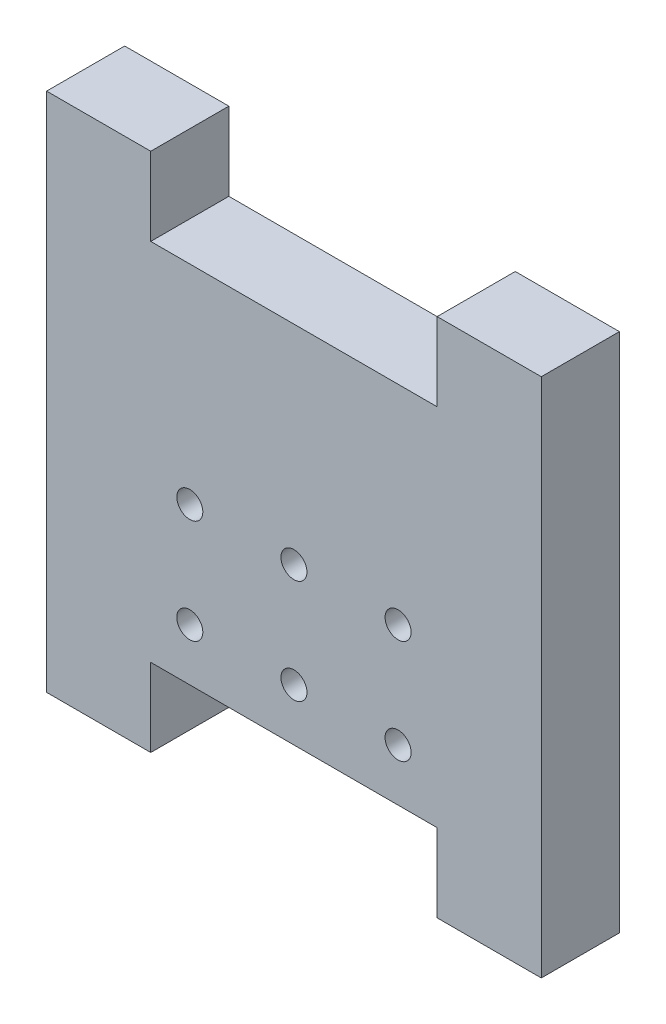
ISO-10303-21;
HEADER;
FILE_DESCRIPTION(('STEP AP214'),'2;1');
FILE_NAME('part.step','',(''),(''),'','','');
FILE_SCHEMA(('AUTOMOTIVE_DESIGN { 1 0 10303 214 1 1 1 1 }'));
ENDSEC;
DATA;
#1=APPLICATION_CONTEXT('core data for automotive mechanical design processes');
#2=APPLICATION_PROTOCOL_DEFINITION('international standard','automotive_design',2000,#1);
#3=PRODUCT_CONTEXT('',#1,'mechanical');
#4=PRODUCT('Part','Part','',(#3));
#5=PRODUCT_RELATED_PRODUCT_CATEGORY('part','',(#4));
#6=PRODUCT_DEFINITION_FORMATION('','',#4);
#7=PRODUCT_DEFINITION_CONTEXT('part definition',#1,'design');
#8=PRODUCT_DEFINITION('design','',#6,#7);
#9=PRODUCT_DEFINITION_SHAPE('','',#8);
#10=(LENGTH_UNIT() NAMED_UNIT(*) SI_UNIT(.MILLI.,.METRE.));
#11=(NAMED_UNIT(*) PLANE_ANGLE_UNIT() SI_UNIT($,.RADIAN.));
#12=(NAMED_UNIT(*) SI_UNIT($,.STERADIAN.) SOLID_ANGLE_UNIT());
#13=UNCERTAINTY_MEASURE_WITH_UNIT(LENGTH_MEASURE(1.E-05),#10,'distance_accuracy_value','');
#14=(GEOMETRIC_REPRESENTATION_CONTEXT(3) GLOBAL_UNCERTAINTY_ASSIGNED_CONTEXT((#13)) GLOBAL_UNIT_ASSIGNED_CONTEXT((#10,
#11,#12)) REPRESENTATION_CONTEXT('',''));
#15=CARTESIAN_POINT('',(0.,0.,0.));
#16=DIRECTION('',(0.,0.,1.));
#17=DIRECTION('',(1.,0.,0.));
#18=AXIS2_PLACEMENT_3D('',#15,#16,#17);
#19=CARTESIAN_POINT('',(103.1875,-72.8936896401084,19.05));
#20=DIRECTION('',(1.,0.,0.));
#21=DIRECTION('',(0.,0.,-1.));
#22=AXIS2_PLACEMENT_3D('',#19,#20,#21);
#23=PLANE('',#22);
#24=DIRECTION('',(0.,-1.,0.));
#25=VECTOR('',#24,1.);
#26=CARTESIAN_POINT('',(103.1875,-72.8936896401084,0.));
#27=LINE('',#26,#25);
#28=CARTESIAN_POINT('',(103.1875,127.,0.));
#29=VERTEX_POINT('',#28);
#30=CARTESIAN_POINT('',(103.1875,0.,0.));
#31=VERTEX_POINT('',#30);
#32=EDGE_CURVE('E152',#29,#31,#27,.T.);
#33=ORIENTED_EDGE('',*,*,#32,.F.);
#34=DIRECTION('',(0.,0.,-1.));
#35=VECTOR('',#34,1.);
#36=CARTESIAN_POINT('',(103.1875,127.,19.05));
#37=LINE('',#36,#35);
#38=CARTESIAN_POINT('',(103.1875,127.,19.05));
#39=VERTEX_POINT('',#38);
#40=EDGE_CURVE('E11',#39,#29,#37,.T.);
#41=ORIENTED_EDGE('',*,*,#40,.F.);
#42=DIRECTION('',(0.,-1.,0.));
#43=VECTOR('',#42,1.);
#44=CARTESIAN_POINT('',(103.1875,-72.8936896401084,19.05));
#45=LINE('',#44,#43);
#46=CARTESIAN_POINT('',(103.1875,0.,19.05));
#47=VERTEX_POINT('',#46);
#48=EDGE_CURVE('E182',#39,#47,#45,.T.);
#49=ORIENTED_EDGE('',*,*,#48,.T.);
#50=DIRECTION('',(0.,0.,-1.));
#51=VECTOR('',#50,1.);
#52=CARTESIAN_POINT('',(103.1875,0.,19.05));
#53=LINE('',#52,#51);
#54=EDGE_CURVE('E97',#47,#31,#53,.T.);
#55=ORIENTED_EDGE('',*,*,#54,.T.);
#56=EDGE_LOOP('',(#33,#41,#49,#55));
#57=FACE_BOUND('',#56,.T.);
#58=ADVANCED_FACE('F35',(#57),#23,.T.);
#59=CARTESIAN_POINT('',(42.8625,127.,19.05));
#60=DIRECTION('',(0.,1.,0.));
#61=DIRECTION('',(0.,0.,1.));
#62=AXIS2_PLACEMENT_3D('',#59,#60,#61);
#63=PLANE('',#62);
#64=DIRECTION('',(1.,0.,0.));
#65=VECTOR('',#64,1.);
#66=CARTESIAN_POINT('',(42.8625,127.,0.));
#67=LINE('',#66,#65);
#68=CARTESIAN_POINT('',(77.7875,127.,0.));
#69=VERTEX_POINT('',#68);
#70=EDGE_CURVE('E155',#69,#29,#67,.T.);
#71=ORIENTED_EDGE('',*,*,#70,.F.);
#72=DIRECTION('',(0.,0.,-1.));
#73=VECTOR('',#72,1.);
#74=CARTESIAN_POINT('',(77.7875,127.,19.05));
#75=LINE('',#74,#73);
#76=CARTESIAN_POINT('',(77.7875,127.,19.05));
#77=VERTEX_POINT('',#76);
#78=EDGE_CURVE('E43',#77,#69,#75,.T.);
#79=ORIENTED_EDGE('',*,*,#78,.F.);
#80=DIRECTION('',(1.,0.,0.));
#81=VECTOR('',#80,1.);
#82=CARTESIAN_POINT('',(42.8625,127.,19.05));
#83=LINE('',#82,#81);
#84=EDGE_CURVE('E213',#77,#39,#83,.T.);
#85=ORIENTED_EDGE('',*,*,#84,.T.);
#86=ORIENTED_EDGE('',*,*,#40,.T.);
#87=EDGE_LOOP('',(#71,#79,#85,#86));
#88=FACE_BOUND('',#87,.T.);
#89=ADVANCED_FACE('F212',(#88),#63,.T.);
#90=CARTESIAN_POINT('',(77.7875,-72.8936896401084,19.05));
#91=DIRECTION('',(1.,0.,0.));
#92=DIRECTION('',(0.,0.,-1.));
#93=AXIS2_PLACEMENT_3D('',#90,#91,#92);
#94=PLANE('',#93);
#95=DIRECTION('',(0.,-1.,0.));
#96=VECTOR('',#95,1.);
#97=CARTESIAN_POINT('',(77.7875,-72.8936896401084,0.));
#98=LINE('',#97,#96);
#99=CARTESIAN_POINT('',(77.7875,107.95,0.));
#100=VERTEX_POINT('',#99);
#101=EDGE_CURVE('E159',#69,#100,#98,.T.);
#102=ORIENTED_EDGE('',*,*,#101,.T.);
#103=DIRECTION('',(0.,0.,-1.));
#104=VECTOR('',#103,1.);
#105=CARTESIAN_POINT('',(77.7875,107.95,19.05));
#106=LINE('',#105,#104);
#107=CARTESIAN_POINT('',(77.7875,107.95,19.05));
#108=VERTEX_POINT('',#107);
#109=EDGE_CURVE('E198',#108,#100,#106,.T.);
#110=ORIENTED_EDGE('',*,*,#109,.F.);
#111=DIRECTION('',(0.,-1.,0.));
#112=VECTOR('',#111,1.);
#113=CARTESIAN_POINT('',(77.7875,-72.8936896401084,19.05));
#114=LINE('',#113,#112);
#115=EDGE_CURVE('E204',#77,#108,#114,.T.);
#116=ORIENTED_EDGE('',*,*,#115,.F.);
#117=ORIENTED_EDGE('',*,*,#78,.T.);
#118=EDGE_LOOP('',(#102,#110,#116,#117));
#119=FACE_BOUND('',#118,.T.);
#120=ADVANCED_FACE('F202',(#119),#94,.F.);
#121=CARTESIAN_POINT('',(42.8625,107.95,19.05));
#122=DIRECTION('',(0.,1.,0.));
#123=DIRECTION('',(0.,0.,1.));
#124=AXIS2_PLACEMENT_3D('',#121,#122,#123);
#125=PLANE('',#124);
#126=DIRECTION('',(1.,0.,0.));
#127=VECTOR('',#126,1.);
#128=CARTESIAN_POINT('',(42.8625,107.95,0.));
#129=LINE('',#128,#127);
#130=CARTESIAN_POINT('',(7.9375,107.95,0.));
#131=VERTEX_POINT('',#130);
#132=EDGE_CURVE('E162',#131,#100,#129,.T.);
#133=ORIENTED_EDGE('',*,*,#132,.F.);
#134=DIRECTION('',(0.,0.,-1.));
#135=VECTOR('',#134,1.);
#136=CARTESIAN_POINT('',(7.9375,107.95,19.05));
#137=LINE('',#136,#135);
#138=CARTESIAN_POINT('',(7.9375,107.95,19.05));
#139=VERTEX_POINT('',#138);
#140=EDGE_CURVE('E196',#139,#131,#137,.T.);
#141=ORIENTED_EDGE('',*,*,#140,.F.);
#142=DIRECTION('',(1.,0.,0.));
#143=VECTOR('',#142,1.);
#144=CARTESIAN_POINT('',(42.8625,107.95,19.05));
#145=LINE('',#144,#143);
#146=EDGE_CURVE('E221',#139,#108,#145,.T.);
#147=ORIENTED_EDGE('',*,*,#146,.T.);
#148=ORIENTED_EDGE('',*,*,#109,.T.);
#149=EDGE_LOOP('',(#133,#141,#147,#148));
#150=FACE_BOUND('',#149,.T.);
#151=ADVANCED_FACE('F255',(#150),#125,.T.);
#152=CARTESIAN_POINT('',(7.93750000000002,-72.8936896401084,19.05));
#153=DIRECTION('',(1.,0.,0.));
#154=DIRECTION('',(0.,1.,0.));
#155=AXIS2_PLACEMENT_3D('',#152,#153,#154);
#156=PLANE('',#155);
#157=DIRECTION('',(0.,-1.,0.));
#158=VECTOR('',#157,1.);
#159=CARTESIAN_POINT('',(7.93750000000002,-72.8936896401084,0.));
#160=LINE('',#159,#158);
#161=CARTESIAN_POINT('',(7.9375,127.,0.));
#162=VERTEX_POINT('',#161);
#163=EDGE_CURVE('E165',#162,#131,#160,.T.);
#164=ORIENTED_EDGE('',*,*,#163,.F.);
#165=DIRECTION('',(0.,0.,-1.));
#166=VECTOR('',#165,1.);
#167=CARTESIAN_POINT('',(7.9375,127.,19.05));
#168=LINE('',#167,#166);
#169=CARTESIAN_POINT('',(7.9375,127.,19.05));
#170=VERTEX_POINT('',#169);
#171=EDGE_CURVE('E194',#170,#162,#168,.T.);
#172=ORIENTED_EDGE('',*,*,#171,.F.);
#173=DIRECTION('',(0.,-1.,0.));
#174=VECTOR('',#173,1.);
#175=CARTESIAN_POINT('',(7.93750000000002,-72.8936896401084,19.05));
#176=LINE('',#175,#174);
#177=EDGE_CURVE('E224',#170,#139,#176,.T.);
#178=ORIENTED_EDGE('',*,*,#177,.T.);
#179=ORIENTED_EDGE('',*,*,#140,.T.);
#180=EDGE_LOOP('',(#164,#172,#178,#179));
#181=FACE_BOUND('',#180,.T.);
#182=ADVANCED_FACE('F252',(#181),#156,.T.);
#183=CARTESIAN_POINT('',(42.8625,127.,19.05));
#184=DIRECTION('',(0.,1.,0.));
#185=DIRECTION('',(0.,0.,1.));
#186=AXIS2_PLACEMENT_3D('',#183,#184,#185);
#187=PLANE('',#186);
#188=DIRECTION('',(1.,0.,0.));
#189=VECTOR('',#188,1.);
#190=CARTESIAN_POINT('',(42.8625,127.,0.));
#191=LINE('',#190,#189);
#192=CARTESIAN_POINT('',(-17.4625,127.,0.));
#193=VERTEX_POINT('',#192);
#194=EDGE_CURVE('E168',#193,#162,#191,.T.);
#195=ORIENTED_EDGE('',*,*,#194,.F.);
#196=DIRECTION('',(0.,0.,-1.));
#197=VECTOR('',#196,1.);
#198=CARTESIAN_POINT('',(-17.4625,127.,19.05));
#199=LINE('',#198,#197);
#200=CARTESIAN_POINT('',(-17.4625,127.,19.05));
#201=VERTEX_POINT('',#200);
#202=EDGE_CURVE('E192',#201,#193,#199,.T.);
#203=ORIENTED_EDGE('',*,*,#202,.F.);
#204=DIRECTION('',(1.,0.,0.));
#205=VECTOR('',#204,1.);
#206=CARTESIAN_POINT('',(42.8625,127.,19.05));
#207=LINE('',#206,#205);
#208=EDGE_CURVE('E227',#201,#170,#207,.T.);
#209=ORIENTED_EDGE('',*,*,#208,.T.);
#210=ORIENTED_EDGE('',*,*,#171,.T.);
#211=EDGE_LOOP('',(#195,#203,#209,#210));
#212=FACE_BOUND('',#211,.T.);
#213=ADVANCED_FACE('F248',(#212),#187,.T.);
#214=CARTESIAN_POINT('',(-17.4625,-72.8936896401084,19.05));
#215=DIRECTION('',(1.,0.,0.));
#216=DIRECTION('',(0.,0.,-1.));
#217=AXIS2_PLACEMENT_3D('',#214,#215,#216);
#218=PLANE('',#217);
#219=DIRECTION('',(0.,-1.,0.));
#220=VECTOR('',#219,1.);
#221=CARTESIAN_POINT('',(-17.4625,-72.8936896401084,0.));
#222=LINE('',#221,#220);
#223=CARTESIAN_POINT('',(-17.4625,0.,0.));
#224=VERTEX_POINT('',#223);
#225=EDGE_CURVE('E171',#193,#224,#222,.T.);
#226=ORIENTED_EDGE('',*,*,#225,.T.);
#227=DIRECTION('',(0.,0.,-1.));
#228=VECTOR('',#227,1.);
#229=CARTESIAN_POINT('',(-17.4625,0.,19.05));
#230=LINE('',#229,#228);
#231=CARTESIAN_POINT('',(-17.4625,0.,19.05));
#232=VERTEX_POINT('',#231);
#233=EDGE_CURVE('E189',#232,#224,#230,.T.);
#234=ORIENTED_EDGE('',*,*,#233,.F.);
#235=DIRECTION('',(0.,-1.,0.));
#236=VECTOR('',#235,1.);
#237=CARTESIAN_POINT('',(-17.4625,-72.8936896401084,19.05));
#238=LINE('',#237,#236);
#239=EDGE_CURVE('E230',#201,#232,#238,.T.);
#240=ORIENTED_EDGE('',*,*,#239,.F.);
#241=ORIENTED_EDGE('',*,*,#202,.T.);
#242=EDGE_LOOP('',(#226,#234,#240,#241));
#243=FACE_BOUND('',#242,.T.);
#244=ADVANCED_FACE('F293',(#243),#218,.F.);
#245=CARTESIAN_POINT('',(42.8625,0.,19.05));
#246=DIRECTION('',(0.,1.,0.));
#247=DIRECTION('',(0.,0.,1.));
#248=AXIS2_PLACEMENT_3D('',#245,#246,#247);
#249=PLANE('',#248);
#250=DIRECTION('',(1.,0.,0.));
#251=VECTOR('',#250,1.);
#252=CARTESIAN_POINT('',(42.8625,0.,0.));
#253=LINE('',#252,#251);
#254=CARTESIAN_POINT('',(7.9375,0.,0.));
#255=VERTEX_POINT('',#254);
#256=EDGE_CURVE('E173',#224,#255,#253,.T.);
#257=ORIENTED_EDGE('',*,*,#256,.T.);
#258=DIRECTION('',(0.,0.,-1.));
#259=VECTOR('',#258,1.);
#260=CARTESIAN_POINT('',(7.9375,0.,19.05));
#261=LINE('',#260,#259);
#262=CARTESIAN_POINT('',(7.9375,0.,19.05));
#263=VERTEX_POINT('',#262);
#264=EDGE_CURVE('E186',#263,#255,#261,.T.);
#265=ORIENTED_EDGE('',*,*,#264,.F.);
#266=DIRECTION('',(1.,0.,0.));
#267=VECTOR('',#266,1.);
#268=CARTESIAN_POINT('',(42.8625,0.,19.05));
#269=LINE('',#268,#267);
#270=EDGE_CURVE('E232',#232,#263,#269,.T.);
#271=ORIENTED_EDGE('',*,*,#270,.F.);
#272=ORIENTED_EDGE('',*,*,#233,.T.);
#273=EDGE_LOOP('',(#257,#265,#271,#272));
#274=FACE_BOUND('',#273,.T.);
#275=ADVANCED_FACE('F239',(#274),#249,.F.);
#276=CARTESIAN_POINT('',(7.9375,-72.8936896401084,19.05));
#277=DIRECTION('',(-1.,0.,0.));
#278=DIRECTION('',(0.,0.,1.));
#279=AXIS2_PLACEMENT_3D('',#276,#277,#278);
#280=PLANE('',#279);
#281=DIRECTION('',(0.,1.,0.));
#282=VECTOR('',#281,1.);
#283=CARTESIAN_POINT('',(7.9375,-72.8936896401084,0.));
#284=LINE('',#283,#282);
#285=CARTESIAN_POINT('',(7.9375,19.05,0.));
#286=VERTEX_POINT('',#285);
#287=EDGE_CURVE('E175',#255,#286,#284,.T.);
#288=ORIENTED_EDGE('',*,*,#287,.T.);
#289=DIRECTION('',(0.,0.,-1.));
#290=VECTOR('',#289,1.);
#291=CARTESIAN_POINT('',(7.9375,19.05,19.05));
#292=LINE('',#291,#290);
#293=CARTESIAN_POINT('',(7.9375,19.05,19.05));
#294=VERTEX_POINT('',#293);
#295=EDGE_CURVE('E145',#294,#286,#292,.T.);
#296=ORIENTED_EDGE('',*,*,#295,.F.);
#297=DIRECTION('',(0.,1.,0.));
#298=VECTOR('',#297,1.);
#299=CARTESIAN_POINT('',(7.9375,-72.8936896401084,19.05));
#300=LINE('',#299,#298);
#301=EDGE_CURVE('E132',#263,#294,#300,.T.);
#302=ORIENTED_EDGE('',*,*,#301,.F.);
#303=ORIENTED_EDGE('',*,*,#264,.T.);
#304=EDGE_LOOP('',(#288,#296,#302,#303));
#305=FACE_BOUND('',#304,.T.);
#306=ADVANCED_FACE('F243',(#305),#280,.F.);
#307=CARTESIAN_POINT('',(42.8625,19.05,19.05));
#308=DIRECTION('',(0.,1.,0.));
#309=DIRECTION('',(0.,0.,1.));
#310=AXIS2_PLACEMENT_3D('',#307,#308,#309);
#311=PLANE('',#310);
#312=DIRECTION('',(1.,0.,0.));
#313=VECTOR('',#312,1.);
#314=CARTESIAN_POINT('',(42.8625,19.05,0.));
#315=LINE('',#314,#313);
#316=CARTESIAN_POINT('',(77.7875,19.05,0.));
#317=VERTEX_POINT('',#316);
#318=EDGE_CURVE('E141',#286,#317,#315,.T.);
#319=ORIENTED_EDGE('',*,*,#318,.T.);
#320=DIRECTION('',(0.,0.,-1.));
#321=VECTOR('',#320,1.);
#322=CARTESIAN_POINT('',(77.7875,19.05,19.05));
#323=LINE('',#322,#321);
#324=CARTESIAN_POINT('',(77.7875,19.05,19.05));
#325=VERTEX_POINT('',#324);
#326=EDGE_CURVE('E138',#325,#317,#323,.T.);
#327=ORIENTED_EDGE('',*,*,#326,.F.);
#328=DIRECTION('',(1.,0.,0.));
#329=VECTOR('',#328,1.);
#330=CARTESIAN_POINT('',(42.8625,19.05,19.05));
#331=LINE('',#330,#329);
#332=EDGE_CURVE('E126',#294,#325,#331,.T.);
#333=ORIENTED_EDGE('',*,*,#332,.F.);
#334=ORIENTED_EDGE('',*,*,#295,.T.);
#335=EDGE_LOOP('',(#319,#327,#333,#334));
#336=FACE_BOUND('',#335,.T.);
#337=ADVANCED_FACE('F139',(#336),#311,.F.);
#338=CARTESIAN_POINT('',(77.7875,-72.8936896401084,19.05));
#339=DIRECTION('',(-1.,0.,0.));
#340=DIRECTION('',(0.,0.,1.));
#341=AXIS2_PLACEMENT_3D('',#338,#339,#340);
#342=PLANE('',#341);
#343=DIRECTION('',(0.,1.,0.));
#344=VECTOR('',#343,1.);
#345=CARTESIAN_POINT('',(77.7875,-72.8936896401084,0.));
#346=LINE('',#345,#344);
#347=CARTESIAN_POINT('',(77.7875,0.,0.));
#348=VERTEX_POINT('',#347);
#349=EDGE_CURVE('E178',#348,#317,#346,.T.);
#350=ORIENTED_EDGE('',*,*,#349,.F.);
#351=DIRECTION('',(0.,0.,-1.));
#352=VECTOR('',#351,1.);
#353=CARTESIAN_POINT('',(77.7875,0.,19.05));
#354=LINE('',#353,#352);
#355=CARTESIAN_POINT('',(77.7875,0.,19.05));
#356=VERTEX_POINT('',#355);
#357=EDGE_CURVE('E90',#356,#348,#354,.T.);
#358=ORIENTED_EDGE('',*,*,#357,.F.);
#359=DIRECTION('',(0.,1.,0.));
#360=VECTOR('',#359,1.);
#361=CARTESIAN_POINT('',(77.7875,-72.8936896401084,19.05));
#362=LINE('',#361,#360);
#363=EDGE_CURVE('E130',#356,#325,#362,.T.);
#364=ORIENTED_EDGE('',*,*,#363,.T.);
#365=ORIENTED_EDGE('',*,*,#326,.T.);
#366=EDGE_LOOP('',(#350,#358,#364,#365));
#367=FACE_BOUND('',#366,.T.);
#368=ADVANCED_FACE('F147',(#367),#342,.T.);
#369=CARTESIAN_POINT('',(42.8625,0.,19.05));
#370=DIRECTION('',(0.,1.,0.));
#371=DIRECTION('',(0.,0.,1.));
#372=AXIS2_PLACEMENT_3D('',#369,#370,#371);
#373=PLANE('',#372);
#374=DIRECTION('',(1.,0.,0.));
#375=VECTOR('',#374,1.);
#376=CARTESIAN_POINT('',(42.8625,0.,0.));
#377=LINE('',#376,#375);
#378=EDGE_CURVE('E180',#348,#31,#377,.T.);
#379=ORIENTED_EDGE('',*,*,#378,.T.);
#380=ORIENTED_EDGE('',*,*,#54,.F.);
#381=DIRECTION('',(1.,0.,0.));
#382=VECTOR('',#381,1.);
#383=CARTESIAN_POINT('',(42.8625,0.,19.05));
#384=LINE('',#383,#382);
#385=EDGE_CURVE('E51',#356,#47,#384,.T.);
#386=ORIENTED_EDGE('',*,*,#385,.F.);
#387=ORIENTED_EDGE('',*,*,#357,.T.);
#388=EDGE_LOOP('',(#379,#380,#386,#387));
#389=FACE_BOUND('',#388,.T.);
#390=ADVANCED_FACE('F214',(#389),#373,.F.);
#391=CARTESIAN_POINT('',(42.8625,-72.8936896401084,19.05));
#392=DIRECTION('',(0.,0.,1.));
#393=DIRECTION('',(1.,0.,0.));
#394=AXIS2_PLACEMENT_3D('',#391,#392,#393);
#395=PLANE('',#394);
#396=CARTESIAN_POINT('',(68.2625,31.75,19.05));
#397=DIRECTION('',(0.,0.,1.));
#398=DIRECTION('',(1.,0.,0.));
#399=AXIS2_PLACEMENT_3D('',#396,#397,#398);
#400=CIRCLE('',#399,3.175);
#401=CARTESIAN_POINT('',(71.4375,31.75,19.05));
#402=VERTEX_POINT('',#401);
#403=EDGE_CURVE('E430',#402,#402,#400,.T.);
#404=ORIENTED_EDGE('',*,*,#403,.F.);
#405=EDGE_LOOP('',(#404));
#406=FACE_BOUND('',#405,.T.);
#407=CARTESIAN_POINT('',(68.2625,57.15,19.05));
#408=DIRECTION('',(0.,0.,1.));
#409=DIRECTION('',(1.,0.,0.));
#410=AXIS2_PLACEMENT_3D('',#407,#408,#409);
#411=CIRCLE('',#410,3.175);
#412=CARTESIAN_POINT('',(71.4375,57.15,19.05));
#413=VERTEX_POINT('',#412);
#414=EDGE_CURVE('E434',#413,#413,#411,.T.);
#415=ORIENTED_EDGE('',*,*,#414,.F.);
#416=EDGE_LOOP('',(#415));
#417=FACE_BOUND('',#416,.T.);
#418=CARTESIAN_POINT('',(42.8625,57.15,19.05));
#419=DIRECTION('',(0.,0.,1.));
#420=DIRECTION('',(1.,0.,0.));
#421=AXIS2_PLACEMENT_3D('',#418,#419,#420);
#422=CIRCLE('',#421,3.175);
#423=CARTESIAN_POINT('',(46.0375,57.15,19.05));
#424=VERTEX_POINT('',#423);
#425=EDGE_CURVE('E443',#424,#424,#422,.T.);
#426=ORIENTED_EDGE('',*,*,#425,.F.);
#427=EDGE_LOOP('',(#426));
#428=FACE_BOUND('',#427,.T.);
#429=CARTESIAN_POINT('',(42.8625,31.75,19.05));
#430=DIRECTION('',(0.,0.,1.));
#431=DIRECTION('',(1.,0.,0.));
#432=AXIS2_PLACEMENT_3D('',#429,#430,#431);
#433=CIRCLE('',#432,3.175);
#434=CARTESIAN_POINT('',(46.0375,31.75,19.05));
#435=VERTEX_POINT('',#434);
#436=EDGE_CURVE('E449',#435,#435,#433,.T.);
#437=ORIENTED_EDGE('',*,*,#436,.F.);
#438=EDGE_LOOP('',(#437));
#439=FACE_BOUND('',#438,.T.);
#440=CARTESIAN_POINT('',(17.4625,31.75,19.05));
#441=DIRECTION('',(0.,0.,1.));
#442=DIRECTION('',(1.,0.,0.));
#443=AXIS2_PLACEMENT_3D('',#440,#441,#442);
#444=CIRCLE('',#443,3.175);
#445=CARTESIAN_POINT('',(20.6375,31.75,19.05));
#446=VERTEX_POINT('',#445);
#447=EDGE_CURVE('E455',#446,#446,#444,.T.);
#448=ORIENTED_EDGE('',*,*,#447,.F.);
#449=EDGE_LOOP('',(#448));
#450=FACE_BOUND('',#449,.T.);
#451=CARTESIAN_POINT('',(17.4625,57.15,19.05));
#452=DIRECTION('',(0.,0.,1.));
#453=DIRECTION('',(1.,0.,0.));
#454=AXIS2_PLACEMENT_3D('',#451,#452,#453);
#455=CIRCLE('',#454,3.175);
#456=CARTESIAN_POINT('',(20.6375,57.15,19.05));
#457=VERTEX_POINT('',#456);
#458=EDGE_CURVE('E460',#457,#457,#455,.T.);
#459=ORIENTED_EDGE('',*,*,#458,.F.);
#460=EDGE_LOOP('',(#459));
#461=FACE_BOUND('',#460,.T.);
#462=ORIENTED_EDGE('',*,*,#48,.F.);
#463=ORIENTED_EDGE('',*,*,#84,.F.);
#464=ORIENTED_EDGE('',*,*,#115,.T.);
#465=ORIENTED_EDGE('',*,*,#146,.F.);
#466=ORIENTED_EDGE('',*,*,#177,.F.);
#467=ORIENTED_EDGE('',*,*,#208,.F.);
#468=ORIENTED_EDGE('',*,*,#239,.T.);
#469=ORIENTED_EDGE('',*,*,#270,.T.);
#470=ORIENTED_EDGE('',*,*,#301,.T.);
#471=ORIENTED_EDGE('',*,*,#332,.T.);
#472=ORIENTED_EDGE('',*,*,#363,.F.);
#473=ORIENTED_EDGE('',*,*,#385,.T.);
#474=EDGE_LOOP('',(#462,#463,#464,#465,#466,#467,#468,#469,#470,#471,#472,#473));
#475=FACE_BOUND('',#474,.T.);
#476=ADVANCED_FACE('F128',(#406,#417,#428,#439,#450,#461,#475),#395,.T.);
#477=CARTESIAN_POINT('',(42.8625,-72.8936896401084,0.));
#478=DIRECTION('',(0.,0.,1.));
#479=DIRECTION('',(1.,0.,0.));
#480=AXIS2_PLACEMENT_3D('',#477,#478,#479);
#481=PLANE('',#480);
#482=CARTESIAN_POINT('',(68.2625,31.75,0.));
#483=DIRECTION('',(0.,0.,1.));
#484=DIRECTION('',(1.,0.,0.));
#485=AXIS2_PLACEMENT_3D('',#482,#483,#484);
#486=CIRCLE('',#485,3.175);
#487=CARTESIAN_POINT('',(71.4375,31.75,0.));
#488=VERTEX_POINT('',#487);
#489=EDGE_CURVE('E433',#488,#488,#486,.F.);
#490=ORIENTED_EDGE('',*,*,#489,.F.);
#491=EDGE_LOOP('',(#490));
#492=FACE_BOUND('',#491,.T.);
#493=CARTESIAN_POINT('',(68.2625,57.15,0.));
#494=DIRECTION('',(0.,0.,1.));
#495=DIRECTION('',(1.,0.,0.));
#496=AXIS2_PLACEMENT_3D('',#493,#494,#495);
#497=CIRCLE('',#496,3.175);
#498=CARTESIAN_POINT('',(71.4375,57.15,0.));
#499=VERTEX_POINT('',#498);
#500=EDGE_CURVE('E437',#499,#499,#497,.F.);
#501=ORIENTED_EDGE('',*,*,#500,.F.);
#502=EDGE_LOOP('',(#501));
#503=FACE_BOUND('',#502,.T.);
#504=CARTESIAN_POINT('',(42.8625,57.15,0.));
#505=DIRECTION('',(0.,0.,1.));
#506=DIRECTION('',(1.,0.,0.));
#507=AXIS2_PLACEMENT_3D('',#504,#505,#506);
#508=CIRCLE('',#507,3.175);
#509=CARTESIAN_POINT('',(46.0375,57.15,0.));
#510=VERTEX_POINT('',#509);
#511=EDGE_CURVE('E446',#510,#510,#508,.F.);
#512=ORIENTED_EDGE('',*,*,#511,.F.);
#513=EDGE_LOOP('',(#512));
#514=FACE_BOUND('',#513,.T.);
#515=CARTESIAN_POINT('',(42.8625,31.75,0.));
#516=DIRECTION('',(0.,0.,1.));
#517=DIRECTION('',(1.,0.,0.));
#518=AXIS2_PLACEMENT_3D('',#515,#516,#517);
#519=CIRCLE('',#518,3.175);
#520=CARTESIAN_POINT('',(46.0375,31.75,0.));
#521=VERTEX_POINT('',#520);
#522=EDGE_CURVE('E452',#521,#521,#519,.F.);
#523=ORIENTED_EDGE('',*,*,#522,.F.);
#524=EDGE_LOOP('',(#523));
#525=FACE_BOUND('',#524,.T.);
#526=CARTESIAN_POINT('',(17.4625,31.75,0.));
#527=DIRECTION('',(0.,0.,1.));
#528=DIRECTION('',(1.,0.,0.));
#529=AXIS2_PLACEMENT_3D('',#526,#527,#528);
#530=CIRCLE('',#529,3.175);
#531=CARTESIAN_POINT('',(20.6375,31.75,0.));
#532=VERTEX_POINT('',#531);
#533=EDGE_CURVE('E458',#532,#532,#530,.F.);
#534=ORIENTED_EDGE('',*,*,#533,.F.);
#535=EDGE_LOOP('',(#534));
#536=FACE_BOUND('',#535,.T.);
#537=CARTESIAN_POINT('',(17.4625,57.15,0.));
#538=DIRECTION('',(0.,0.,1.));
#539=DIRECTION('',(1.,0.,0.));
#540=AXIS2_PLACEMENT_3D('',#537,#538,#539);
#541=CIRCLE('',#540,3.175);
#542=CARTESIAN_POINT('',(20.6375,57.15,0.));
#543=VERTEX_POINT('',#542);
#544=EDGE_CURVE('E156',#543,#543,#541,.F.);
#545=ORIENTED_EDGE('',*,*,#544,.F.);
#546=EDGE_LOOP('',(#545));
#547=FACE_BOUND('',#546,.T.);
#548=ORIENTED_EDGE('',*,*,#32,.T.);
#549=ORIENTED_EDGE('',*,*,#378,.F.);
#550=ORIENTED_EDGE('',*,*,#349,.T.);
#551=ORIENTED_EDGE('',*,*,#318,.F.);
#552=ORIENTED_EDGE('',*,*,#287,.F.);
#553=ORIENTED_EDGE('',*,*,#256,.F.);
#554=ORIENTED_EDGE('',*,*,#225,.F.);
#555=ORIENTED_EDGE('',*,*,#194,.T.);
#556=ORIENTED_EDGE('',*,*,#163,.T.);
#557=ORIENTED_EDGE('',*,*,#132,.T.);
#558=ORIENTED_EDGE('',*,*,#101,.F.);
#559=ORIENTED_EDGE('',*,*,#70,.T.);
#560=EDGE_LOOP('',(#548,#549,#550,#551,#552,#553,#554,#555,#556,#557,#558,#559));
#561=FACE_BOUND('',#560,.T.);
#562=ADVANCED_FACE('F210',(#492,#503,#514,#525,#536,#547,#561),#481,.F.);
#563=CARTESIAN_POINT('',(17.4625,57.15,-0.001000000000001));
#564=DIRECTION('',(0.,0.,1.));
#565=DIRECTION('',(1.,0.,0.));
#566=AXIS2_PLACEMENT_3D('',#563,#564,#565);
#567=CYLINDRICAL_SURFACE('',#566,3.175);
#568=ORIENTED_EDGE('',*,*,#458,.T.);
#569=EDGE_LOOP('',(#568));
#570=FACE_BOUND('',#569,.T.);
#571=ORIENTED_EDGE('',*,*,#544,.T.);
#572=EDGE_LOOP('',(#571));
#573=FACE_BOUND('',#572,.T.);
#574=ADVANCED_FACE('F362',(#570,#573),#567,.F.);
#575=CARTESIAN_POINT('',(17.4625,31.75,-0.001000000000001));
#576=DIRECTION('',(0.,0.,1.));
#577=DIRECTION('',(1.,0.,0.));
#578=AXIS2_PLACEMENT_3D('',#575,#576,#577);
#579=CYLINDRICAL_SURFACE('',#578,3.175);
#580=ORIENTED_EDGE('',*,*,#447,.T.);
#581=EDGE_LOOP('',(#580));
#582=FACE_BOUND('',#581,.T.);
#583=ORIENTED_EDGE('',*,*,#533,.T.);
#584=EDGE_LOOP('',(#583));
#585=FACE_BOUND('',#584,.T.);
#586=ADVANCED_FACE('F373',(#582,#585),#579,.F.);
#587=CARTESIAN_POINT('',(42.8625,31.75,-0.001000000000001));
#588=DIRECTION('',(0.,0.,1.));
#589=DIRECTION('',(1.,0.,0.));
#590=AXIS2_PLACEMENT_3D('',#587,#588,#589);
#591=CYLINDRICAL_SURFACE('',#590,3.175);
#592=ORIENTED_EDGE('',*,*,#436,.T.);
#593=EDGE_LOOP('',(#592));
#594=FACE_BOUND('',#593,.T.);
#595=ORIENTED_EDGE('',*,*,#522,.T.);
#596=EDGE_LOOP('',(#595));
#597=FACE_BOUND('',#596,.T.);
#598=ADVANCED_FACE('F383',(#594,#597),#591,.F.);
#599=CARTESIAN_POINT('',(42.8625,57.15,-0.001000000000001));
#600=DIRECTION('',(0.,0.,1.));
#601=DIRECTION('',(1.,0.,0.));
#602=AXIS2_PLACEMENT_3D('',#599,#600,#601);
#603=CYLINDRICAL_SURFACE('',#602,3.175);
#604=ORIENTED_EDGE('',*,*,#425,.T.);
#605=EDGE_LOOP('',(#604));
#606=FACE_BOUND('',#605,.T.);
#607=ORIENTED_EDGE('',*,*,#511,.T.);
#608=EDGE_LOOP('',(#607));
#609=FACE_BOUND('',#608,.T.);
#610=ADVANCED_FACE('F393',(#606,#609),#603,.F.);
#611=CARTESIAN_POINT('',(68.2625,57.15,-0.001000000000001));
#612=DIRECTION('',(0.,0.,1.));
#613=DIRECTION('',(1.,0.,0.));
#614=AXIS2_PLACEMENT_3D('',#611,#612,#613);
#615=CYLINDRICAL_SURFACE('',#614,3.175);
#616=ORIENTED_EDGE('',*,*,#414,.T.);
#617=EDGE_LOOP('',(#616));
#618=FACE_BOUND('',#617,.T.);
#619=ORIENTED_EDGE('',*,*,#500,.T.);
#620=EDGE_LOOP('',(#619));
#621=FACE_BOUND('',#620,.T.);
#622=ADVANCED_FACE('F403',(#618,#621),#615,.F.);
#623=CARTESIAN_POINT('',(68.2625,31.75,-0.001000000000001));
#624=DIRECTION('',(0.,0.,1.));
#625=DIRECTION('',(1.,0.,0.));
#626=AXIS2_PLACEMENT_3D('',#623,#624,#625);
#627=CYLINDRICAL_SURFACE('',#626,3.175);
#628=ORIENTED_EDGE('',*,*,#403,.T.);
#629=EDGE_LOOP('',(#628));
#630=FACE_BOUND('',#629,.T.);
#631=ORIENTED_EDGE('',*,*,#489,.T.);
#632=EDGE_LOOP('',(#631));
#633=FACE_BOUND('',#632,.T.);
#634=ADVANCED_FACE('F413',(#630,#633),#627,.F.);
#635=CLOSED_SHELL('',(#58,#89,#120,#151,#182,#213,#244,#275,#306,#337,#368,#390,#476,#562,#574,
#586,#598,#610,#622,#634));
#636=MANIFOLD_SOLID_BREP('B2',#635);
#637=ADVANCED_BREP_SHAPE_REPRESENTATION('',(#18,#636),#14);
#638=SHAPE_DEFINITION_REPRESENTATION(#9,#637);
ENDSEC;
END-ISO-10303-21;
